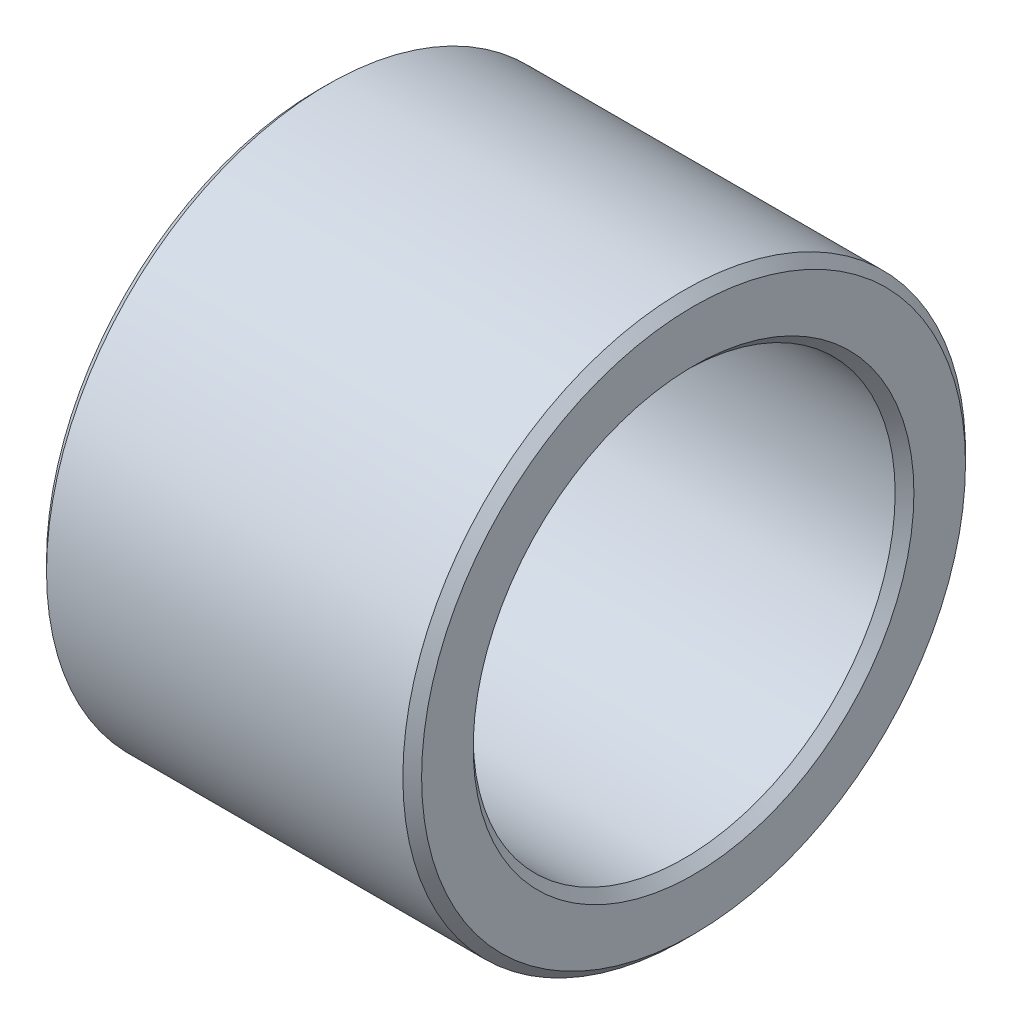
ISO-10303-21;
HEADER;
FILE_DESCRIPTION(('STEP AP214'),'2;1');
FILE_NAME('part.step','',(''),(''),'','','');
FILE_SCHEMA(('AUTOMOTIVE_DESIGN { 1 0 10303 214 1 1 1 1 }'));
ENDSEC;
DATA;
#1=APPLICATION_CONTEXT('core data for automotive mechanical design processes');
#2=APPLICATION_PROTOCOL_DEFINITION('international standard','automotive_design',2000,#1);
#3=PRODUCT_CONTEXT('',#1,'mechanical');
#4=PRODUCT('Part','Part','',(#3));
#5=PRODUCT_RELATED_PRODUCT_CATEGORY('part','',(#4));
#6=PRODUCT_DEFINITION_FORMATION('','',#4);
#7=PRODUCT_DEFINITION_CONTEXT('part definition',#1,'design');
#8=PRODUCT_DEFINITION('design','',#6,#7);
#9=PRODUCT_DEFINITION_SHAPE('','',#8);
#10=(LENGTH_UNIT() NAMED_UNIT(*) SI_UNIT(.MILLI.,.METRE.));
#11=(NAMED_UNIT(*) PLANE_ANGLE_UNIT() SI_UNIT($,.RADIAN.));
#12=(NAMED_UNIT(*) SI_UNIT($,.STERADIAN.) SOLID_ANGLE_UNIT());
#13=UNCERTAINTY_MEASURE_WITH_UNIT(LENGTH_MEASURE(1.E-05),#10,'distance_accuracy_value','');
#14=(GEOMETRIC_REPRESENTATION_CONTEXT(3) GLOBAL_UNCERTAINTY_ASSIGNED_CONTEXT((#13)) GLOBAL_UNIT_ASSIGNED_CONTEXT((#10,
#11,#12)) REPRESENTATION_CONTEXT('',''));
#15=CARTESIAN_POINT('',(0.,0.,0.));
#16=DIRECTION('',(0.,0.,1.));
#17=DIRECTION('',(1.,0.,0.));
#18=AXIS2_PLACEMENT_3D('',#15,#16,#17);
#19=CARTESIAN_POINT('',(2.22044604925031E-13,4.44089209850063E-13,0.));
#20=DIRECTION('',(-1.,0.,0.));
#21=DIRECTION('',(0.,0.,1.));
#22=AXIS2_PLACEMENT_3D('',#19,#20,#21);
#23=CONICAL_SURFACE('',#22,9.4,0.785398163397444);
#24=CARTESIAN_POINT('',(0.399999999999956,4.44089209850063E-13,-1.11022302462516E-13));
#25=DIRECTION('',(-1.,0.,0.));
#26=DIRECTION('',(0.,0.,1.));
#27=AXIS2_PLACEMENT_3D('',#24,#25,#26);
#28=CIRCLE('',#27,9.);
#29=CARTESIAN_POINT('',(0.399999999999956,4.44423664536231E-13,9.00000000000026));
#30=VERTEX_POINT('',#29);
#31=EDGE_CURVE('E58',#30,#30,#28,.T.);
#32=CARTESIAN_POINT('',(2.22044604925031E-13,4.44089209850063E-13,0.));
#33=DIRECTION('',(-1.,0.,0.));
#34=DIRECTION('',(0.,0.,1.));
#35=AXIS2_PLACEMENT_3D('',#32,#33,#34);
#36=CIRCLE('',#35,9.4);
#37=CARTESIAN_POINT('',(2.21653251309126E-13,4.44415337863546E-13,9.39999999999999));
#38=VERTEX_POINT('',#37);
#39=EDGE_CURVE('E10',#38,#38,#36,.T.);
#40=CARTESIAN_POINT('',(0.399999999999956,4.44423664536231E-13,9.00000000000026));
#41=CARTESIAN_POINT('',(0.395833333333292,4.44423577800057E-13,9.00416666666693));
#42=CARTESIAN_POINT('',(0.391666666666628,4.44423491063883E-13,9.00833333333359));
#43=CARTESIAN_POINT('',(0.3833333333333,4.44423317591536E-13,9.01666666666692));
#44=CARTESIAN_POINT('',(0.379166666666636,4.44423230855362E-13,9.02083333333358));
#45=CARTESIAN_POINT('',(0.370833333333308,4.44423057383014E-13,9.02916666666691));
#46=CARTESIAN_POINT('',(0.366666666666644,4.4442297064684E-13,9.03333333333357));
#47=CARTESIAN_POINT('',(0.358333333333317,4.44422797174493E-13,9.0416666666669));
#48=CARTESIAN_POINT('',(0.354166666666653,4.44422710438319E-13,9.04583333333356));
#49=CARTESIAN_POINT('',(0.345833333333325,4.44422536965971E-13,9.05416666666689));
#50=CARTESIAN_POINT('',(0.341666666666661,4.44422450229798E-13,9.05833333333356));
#51=CARTESIAN_POINT('',(0.333333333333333,4.4442227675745E-13,9.06666666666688));
#52=CARTESIAN_POINT('',(0.329166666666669,4.44422190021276E-13,9.07083333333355));
#53=CARTESIAN_POINT('',(0.320833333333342,4.44422016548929E-13,9.07916666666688));
#54=CARTESIAN_POINT('',(0.316666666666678,4.44421929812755E-13,9.08333333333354));
#55=CARTESIAN_POINT('',(0.30833333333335,4.44421756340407E-13,9.09166666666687));
#56=CARTESIAN_POINT('',(0.304166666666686,4.44421669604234E-13,9.09583333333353));
#57=CARTESIAN_POINT('',(0.295833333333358,4.44421496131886E-13,9.10416666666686));
#58=CARTESIAN_POINT('',(0.291666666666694,4.44421409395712E-13,9.10833333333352));
#59=CARTESIAN_POINT('',(0.283333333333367,4.44421235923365E-13,9.11666666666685));
#60=CARTESIAN_POINT('',(0.279166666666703,4.44421149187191E-13,9.12083333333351));
#61=CARTESIAN_POINT('',(0.270833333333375,4.44420975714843E-13,9.12916666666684));
#62=CARTESIAN_POINT('',(0.266666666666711,4.44420888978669E-13,9.13333333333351));
#63=CARTESIAN_POINT('',(0.258333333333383,4.44420715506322E-13,9.14166666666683));
#64=CARTESIAN_POINT('',(0.254166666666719,4.44420628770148E-13,9.1458333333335));
#65=CARTESIAN_POINT('',(0.245833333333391,4.444204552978E-13,9.15416666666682));
#66=CARTESIAN_POINT('',(0.241666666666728,4.44420368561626E-13,9.15833333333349));
#67=CARTESIAN_POINT('',(0.2333333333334,4.44420195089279E-13,9.16666666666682));
#68=CARTESIAN_POINT('',(0.229166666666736,4.44420108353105E-13,9.17083333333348));
#69=CARTESIAN_POINT('',(0.220833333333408,4.44419934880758E-13,9.17916666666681));
#70=CARTESIAN_POINT('',(0.216666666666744,4.44419848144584E-13,9.18333333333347));
#71=CARTESIAN_POINT('',(0.208333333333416,4.44419674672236E-13,9.1916666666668));
#72=CARTESIAN_POINT('',(0.204166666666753,4.44419587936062E-13,9.19583333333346));
#73=CARTESIAN_POINT('',(0.195833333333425,4.44419414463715E-13,9.20416666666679));
#74=CARTESIAN_POINT('',(0.191666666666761,4.44419327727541E-13,9.20833333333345));
#75=CARTESIAN_POINT('',(0.183333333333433,4.44419154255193E-13,9.21666666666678));
#76=CARTESIAN_POINT('',(0.179166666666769,4.4441906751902E-13,9.22083333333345));
#77=CARTESIAN_POINT('',(0.170833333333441,4.44418894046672E-13,9.22916666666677));
#78=CARTESIAN_POINT('',(0.166666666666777,4.44418807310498E-13,9.23333333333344));
#79=CARTESIAN_POINT('',(0.15833333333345,4.44418633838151E-13,9.24166666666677));
#80=CARTESIAN_POINT('',(0.154166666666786,4.44418547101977E-13,9.24583333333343));
#81=CARTESIAN_POINT('',(0.145833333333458,4.44418373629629E-13,9.25416666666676));
#82=CARTESIAN_POINT('',(0.141666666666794,4.44418286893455E-13,9.25833333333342));
#83=CARTESIAN_POINT('',(0.133333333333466,4.44418113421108E-13,9.26666666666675));
#84=CARTESIAN_POINT('',(0.129166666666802,4.44418026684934E-13,9.27083333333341));
#85=CARTESIAN_POINT('',(0.120833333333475,4.44417853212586E-13,9.27916666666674));
#86=CARTESIAN_POINT('',(0.116666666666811,4.44417766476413E-13,9.2833333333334));
#87=CARTESIAN_POINT('',(0.108333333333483,4.44417593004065E-13,9.29166666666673));
#88=CARTESIAN_POINT('',(0.104166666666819,4.44417506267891E-13,9.29583333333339));
#89=CARTESIAN_POINT('',(0.0958333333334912,4.44417332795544E-13,9.30416666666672));
#90=CARTESIAN_POINT('',(0.0916666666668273,4.4441724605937E-13,9.30833333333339));
#91=CARTESIAN_POINT('',(0.0833333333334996,4.44417072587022E-13,9.31666666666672));
#92=CARTESIAN_POINT('',(0.0791666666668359,4.44416985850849E-13,9.32083333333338));
#93=CARTESIAN_POINT('',(0.070833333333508,4.44416812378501E-13,9.32916666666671));
#94=CARTESIAN_POINT('',(0.0666666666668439,4.44416725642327E-13,9.33333333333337));
#95=CARTESIAN_POINT('',(0.058333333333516,4.4441655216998E-13,9.3416666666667));
#96=CARTESIAN_POINT('',(0.0541666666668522,4.44416465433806E-13,9.34583333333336));
#97=CARTESIAN_POINT('',(0.0458333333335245,4.44416291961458E-13,9.35416666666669));
#98=CARTESIAN_POINT('',(0.0416666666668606,4.44416205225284E-13,9.35833333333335));
#99=CARTESIAN_POINT('',(0.0333333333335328,4.44416031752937E-13,9.36666666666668));
#100=CARTESIAN_POINT('',(0.0291666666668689,4.44415945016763E-13,9.37083333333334));
#101=CARTESIAN_POINT('',(0.0208333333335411,4.44415771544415E-13,9.37916666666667));
#102=CARTESIAN_POINT('',(0.0166666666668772,4.44415684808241E-13,9.38333333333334));
#103=CARTESIAN_POINT('',(0.00833333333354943,4.44415511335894E-13,9.39166666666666));
#104=CARTESIAN_POINT('',(0.00416666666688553,4.4441542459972E-13,9.39583333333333));
#105=CARTESIAN_POINT('',(2.21643103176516E-13,4.44415337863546E-13,9.39999999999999));
#106=B_SPLINE_CURVE_WITH_KNOTS('',3,(#40,#41,#42,#43,#44,#45,#46,#47,#48,#49,#50,#51,#52,#53,
#54,#55,#56,#57,#58,#59,#60,#61,#62,#63,#64,#65,#66,#67,#68,#69,#70,#71,#72,#73,#74,#75,#76,#77,
#78,#79,#80,#81,#82,#83,#84,#85,#86,#87,#88,#89,#90,#91,#92,#93,#94,#95,#96,#97,#98,#99,#100,
#101,#102,#103,#104,#105),.UNSPECIFIED.,.F.,.F.,(4,2,2,2,2,2,2,2,2,2,2,2,2,2,2,2,2,2,2,2,2,2,2,
2,2,2,2,2,2,2,2,2,4),(0.,0.0176776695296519,0.0353553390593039,0.0530330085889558,
0.0707106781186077,0.0883883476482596,0.106066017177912,0.123743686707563,0.141421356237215,
0.159099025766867,0.176776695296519,0.194454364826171,0.212132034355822,0.229809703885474,
0.247487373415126,0.265165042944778,0.28284271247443,0.300520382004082,0.318198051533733,
0.335875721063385,0.353553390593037,0.371231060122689,0.388908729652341,0.406586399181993,
0.424264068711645,0.441941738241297,0.459619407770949,0.4772970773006,0.494974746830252,
0.512652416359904,0.530330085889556,0.548007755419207,0.565685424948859),.UNSPECIFIED.);
#107=EDGE_CURVE('BSEAM30',#30,#38,#106,.T.);
#108=ORIENTED_EDGE('',*,*,#31,.F.);
#109=ORIENTED_EDGE('',*,*,#39,.T.);
#110=ORIENTED_EDGE('',*,*,#107,.T.);
#111=ORIENTED_EDGE('',*,*,#107,.F.);
#112=EDGE_LOOP('',(#108,#110,#109,#111));
#113=FACE_BOUND('',#112,.T.);
#114=ADVANCED_FACE('F30',(#113),#23,.F.);
#115=CARTESIAN_POINT('',(0.,9.4000000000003,0.));
#116=DIRECTION('',(1.,0.,0.));
#117=DIRECTION('',(0.,0.,-1.));
#118=AXIS2_PLACEMENT_3D('',#115,#116,#117);
#119=PLANE('',#118);
#120=ORIENTED_EDGE('',*,*,#39,.F.);
#121=EDGE_LOOP('',(#120));
#122=FACE_BOUND('',#121,.T.);
#123=CARTESIAN_POINT('',(2.22044604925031E-13,4.44089209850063E-13,0.));
#124=DIRECTION('',(-1.,0.,0.));
#125=DIRECTION('',(0.,0.,1.));
#126=AXIS2_PLACEMENT_3D('',#123,#124,#125);
#127=CIRCLE('',#126,11.6);
#128=CARTESIAN_POINT('',(2.2253249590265E-13,4.43664549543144E-13,-11.6000000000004));
#129=VERTEX_POINT('',#128);
#130=EDGE_CURVE('E36',#129,#129,#127,.T.);
#131=ORIENTED_EDGE('',*,*,#130,.T.);
#132=EDGE_LOOP('',(#131));
#133=FACE_BOUND('',#132,.T.);
#134=ADVANCED_FACE('F65',(#122,#133),#119,.F.);
#135=CARTESIAN_POINT('',(0.399999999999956,4.44089209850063E-13,-1.11022302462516E-13));
#136=DIRECTION('',(1.,0.,0.));
#137=DIRECTION('',(0.,0.,-1.));
#138=AXIS2_PLACEMENT_3D('',#135,#136,#137);
#139=CONICAL_SURFACE('',#138,12.,0.785398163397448);
#140=CARTESIAN_POINT('',(0.399999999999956,4.44089209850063E-13,-1.11022302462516E-13));
#141=DIRECTION('',(-1.,0.,0.));
#142=DIRECTION('',(0.,0.,1.));
#143=AXIS2_PLACEMENT_3D('',#140,#141,#142);
#144=CIRCLE('',#143,12.);
#145=CARTESIAN_POINT('',(0.399999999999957,4.43672876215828E-13,-12.0000000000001));
#146=VERTEX_POINT('',#145);
#147=EDGE_CURVE('E40',#146,#146,#144,.T.);
#148=CARTESIAN_POINT('',(2.2253249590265E-13,4.43664549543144E-13,-11.6000000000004));
#149=CARTESIAN_POINT('',(0.00416666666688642,4.43664636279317E-13,-11.604166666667));
#150=CARTESIAN_POINT('',(0.00833333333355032,4.43664723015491E-13,-11.6083333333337));
#151=CARTESIAN_POINT('',(0.0166666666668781,4.43664896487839E-13,-11.616666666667));
#152=CARTESIAN_POINT('',(0.020833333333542,4.43664983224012E-13,-11.6208333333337));
#153=CARTESIAN_POINT('',(0.0291666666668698,4.4366515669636E-13,-11.629166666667));
#154=CARTESIAN_POINT('',(0.0333333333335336,4.43665243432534E-13,-11.6333333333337));
#155=CARTESIAN_POINT('',(0.0416666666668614,4.43665416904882E-13,-11.641666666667));
#156=CARTESIAN_POINT('',(0.0458333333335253,4.43665503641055E-13,-11.6458333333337));
#157=CARTESIAN_POINT('',(0.0541666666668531,4.43665677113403E-13,-11.654166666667));
#158=CARTESIAN_POINT('',(0.058333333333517,4.43665763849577E-13,-11.6583333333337));
#159=CARTESIAN_POINT('',(0.0666666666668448,4.43665937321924E-13,-11.666666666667));
#160=CARTESIAN_POINT('',(0.0708333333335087,4.43666024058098E-13,-11.6708333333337));
#161=CARTESIAN_POINT('',(0.0791666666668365,4.43666197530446E-13,-11.679166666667));
#162=CARTESIAN_POINT('',(0.0833333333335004,4.43666284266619E-13,-11.6833333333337));
#163=CARTESIAN_POINT('',(0.0916666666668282,4.43666457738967E-13,-11.691666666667));
#164=CARTESIAN_POINT('',(0.0958333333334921,4.43666544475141E-13,-11.6958333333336));
#165=CARTESIAN_POINT('',(0.10416666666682,4.43666717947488E-13,-11.704166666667));
#166=CARTESIAN_POINT('',(0.108333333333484,4.43666804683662E-13,-11.7083333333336));
#167=CARTESIAN_POINT('',(0.116666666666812,4.4366697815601E-13,-11.716666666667));
#168=CARTESIAN_POINT('',(0.120833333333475,4.43667064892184E-13,-11.7208333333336));
#169=CARTESIAN_POINT('',(0.129166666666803,4.43667238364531E-13,-11.729166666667));
#170=CARTESIAN_POINT('',(0.133333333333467,4.43667325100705E-13,-11.7333333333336));
#171=CARTESIAN_POINT('',(0.141666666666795,4.43667498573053E-13,-11.7416666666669));
#172=CARTESIAN_POINT('',(0.145833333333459,4.43667585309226E-13,-11.7458333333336));
#173=CARTESIAN_POINT('',(0.154166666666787,4.43667758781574E-13,-11.7541666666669));
#174=CARTESIAN_POINT('',(0.158333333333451,4.43667845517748E-13,-11.7583333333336));
#175=CARTESIAN_POINT('',(0.166666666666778,4.43668018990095E-13,-11.7666666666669));
#176=CARTESIAN_POINT('',(0.170833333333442,4.43668105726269E-13,-11.7708333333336));
#177=CARTESIAN_POINT('',(0.17916666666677,4.43668279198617E-13,-11.7791666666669));
#178=CARTESIAN_POINT('',(0.183333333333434,4.43668365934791E-13,-11.7833333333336));
#179=CARTESIAN_POINT('',(0.191666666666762,4.43668539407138E-13,-11.7916666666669));
#180=CARTESIAN_POINT('',(0.195833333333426,4.43668626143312E-13,-11.7958333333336));
#181=CARTESIAN_POINT('',(0.204166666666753,4.4366879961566E-13,-11.8041666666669));
#182=CARTESIAN_POINT('',(0.208333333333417,4.43668886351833E-13,-11.8083333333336));
#183=CARTESIAN_POINT('',(0.216666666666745,4.43669059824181E-13,-11.8166666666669));
#184=CARTESIAN_POINT('',(0.220833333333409,4.43669146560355E-13,-11.8208333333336));
#185=CARTESIAN_POINT('',(0.229166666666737,4.43669320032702E-13,-11.8291666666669));
#186=CARTESIAN_POINT('',(0.233333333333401,4.43669406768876E-13,-11.8333333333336));
#187=CARTESIAN_POINT('',(0.241666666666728,4.43669580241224E-13,-11.8416666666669));
#188=CARTESIAN_POINT('',(0.245833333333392,4.43669666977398E-13,-11.8458333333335));
#189=CARTESIAN_POINT('',(0.25416666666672,4.43669840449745E-13,-11.8541666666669));
#190=CARTESIAN_POINT('',(0.258333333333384,4.43669927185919E-13,-11.8583333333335));
#191=CARTESIAN_POINT('',(0.266666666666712,4.43670100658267E-13,-11.8666666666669));
#192=CARTESIAN_POINT('',(0.270833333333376,4.4367018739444E-13,-11.8708333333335));
#193=CARTESIAN_POINT('',(0.279166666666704,4.43670360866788E-13,-11.8791666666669));
#194=CARTESIAN_POINT('',(0.283333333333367,4.43670447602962E-13,-11.8833333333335));
#195=CARTESIAN_POINT('',(0.291666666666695,4.43670621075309E-13,-11.8916666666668));
#196=CARTESIAN_POINT('',(0.295833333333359,4.43670707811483E-13,-11.8958333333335));
#197=CARTESIAN_POINT('',(0.304166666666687,4.43670881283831E-13,-11.9041666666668));
#198=CARTESIAN_POINT('',(0.308333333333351,4.43670968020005E-13,-11.9083333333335));
#199=CARTESIAN_POINT('',(0.316666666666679,4.43671141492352E-13,-11.9166666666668));
#200=CARTESIAN_POINT('',(0.320833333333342,4.43671228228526E-13,-11.9208333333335));
#201=CARTESIAN_POINT('',(0.32916666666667,4.43671401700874E-13,-11.9291666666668));
#202=CARTESIAN_POINT('',(0.333333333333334,4.43671488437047E-13,-11.9333333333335));
#203=CARTESIAN_POINT('',(0.341666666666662,4.43671661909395E-13,-11.9416666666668));
#204=CARTESIAN_POINT('',(0.345833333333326,4.43671748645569E-13,-11.9458333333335));
#205=CARTESIAN_POINT('',(0.354166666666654,4.43671922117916E-13,-11.9541666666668));
#206=CARTESIAN_POINT('',(0.358333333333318,4.4367200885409E-13,-11.9583333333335));
#207=CARTESIAN_POINT('',(0.366666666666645,4.43672182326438E-13,-11.9666666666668));
#208=CARTESIAN_POINT('',(0.370833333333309,4.43672269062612E-13,-11.9708333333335));
#209=CARTESIAN_POINT('',(0.379166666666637,4.43672442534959E-13,-11.9791666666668));
#210=CARTESIAN_POINT('',(0.383333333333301,4.43672529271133E-13,-11.9833333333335));
#211=CARTESIAN_POINT('',(0.391666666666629,4.43672702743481E-13,-11.9916666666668));
#212=CARTESIAN_POINT('',(0.395833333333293,4.43672789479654E-13,-11.9958333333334));
#213=CARTESIAN_POINT('',(0.399999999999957,4.43672876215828E-13,-12.0000000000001));
#214=B_SPLINE_CURVE_WITH_KNOTS('',3,(#148,#149,#150,#151,#152,#153,#154,#155,#156,#157,#158,
#159,#160,#161,#162,#163,#164,#165,#166,#167,#168,#169,#170,#171,#172,#173,#174,#175,#176,#177,
#178,#179,#180,#181,#182,#183,#184,#185,#186,#187,#188,#189,#190,#191,#192,#193,#194,#195,#196,
#197,#198,#199,#200,#201,#202,#203,#204,#205,#206,#207,#208,#209,#210,#211,#212,#213),
.UNSPECIFIED.,.F.,.F.,(4,2,2,2,2,2,2,2,2,2,2,2,2,2,2,2,2,2,2,2,2,2,2,2,2,2,2,2,2,2,2,2,4),(0.,
0.0176776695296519,0.0353553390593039,0.0530330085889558,0.0707106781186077,0.0883883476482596,
0.106066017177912,0.123743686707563,0.141421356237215,0.159099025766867,0.176776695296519,
0.194454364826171,0.212132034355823,0.229809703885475,0.247487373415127,0.265165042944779,
0.282842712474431,0.300520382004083,0.318198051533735,0.335875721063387,0.353553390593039,
0.371231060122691,0.388908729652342,0.406586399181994,0.424264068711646,0.441941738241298,
0.45961940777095,0.477297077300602,0.494974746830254,0.512652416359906,0.530330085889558,
0.54800775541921,0.565685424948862),.UNSPECIFIED.);
#215=EDGE_CURVE('BSEAM69',#129,#146,#214,.T.);
#216=ORIENTED_EDGE('',*,*,#130,.F.);
#217=ORIENTED_EDGE('',*,*,#147,.T.);
#218=ORIENTED_EDGE('',*,*,#215,.T.);
#219=ORIENTED_EDGE('',*,*,#215,.F.);
#220=EDGE_LOOP('',(#216,#218,#217,#219));
#221=FACE_BOUND('',#220,.T.);
#222=ADVANCED_FACE('F69',(#221),#139,.T.);
#223=CARTESIAN_POINT('',(2.22044604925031E-13,4.44089209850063E-13,0.));
#224=DIRECTION('',(-1.,0.,0.));
#225=DIRECTION('',(0.,0.,1.));
#226=AXIS2_PLACEMENT_3D('',#223,#224,#225);
#227=CYLINDRICAL_SURFACE('',#226,12.);
#228=ORIENTED_EDGE('',*,*,#147,.F.);
#229=EDGE_LOOP('',(#228));
#230=FACE_BOUND('',#229,.T.);
#231=CARTESIAN_POINT('',(15.6000000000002,-2.22044604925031E-13,0.));
#232=DIRECTION('',(-1.,0.,0.));
#233=DIRECTION('',(0.,0.,1.));
#234=AXIS2_PLACEMENT_3D('',#231,#232,#233);
#235=CIRCLE('',#234,12.);
#236=CARTESIAN_POINT('',(15.6000000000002,0.,11.9999999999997));
#237=VERTEX_POINT('',#236);
#238=EDGE_CURVE('E44',#237,#237,#235,.T.);
#239=ORIENTED_EDGE('',*,*,#238,.T.);
#240=EDGE_LOOP('',(#239));
#241=FACE_BOUND('',#240,.T.);
#242=ADVANCED_FACE('F74',(#230,#241),#227,.T.);
#243=CARTESIAN_POINT('',(15.9999999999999,0.,0.));
#244=DIRECTION('',(-1.,0.,0.));
#245=DIRECTION('',(0.,0.,1.));
#246=AXIS2_PLACEMENT_3D('',#243,#244,#245);
#247=CONICAL_SURFACE('',#246,11.6,0.785398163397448);
#248=CARTESIAN_POINT('',(15.9999999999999,0.,0.));
#249=DIRECTION('',(-1.,0.,0.));
#250=DIRECTION('',(0.,0.,1.));
#251=AXIS2_PLACEMENT_3D('',#248,#249,#250);
#252=CIRCLE('',#251,11.6);
#253=CARTESIAN_POINT('',(15.9999999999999,0.,11.6));
#254=VERTEX_POINT('',#253);
#255=EDGE_CURVE('E49',#254,#254,#252,.T.);
#256=CARTESIAN_POINT('',(15.6000000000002,0.,11.9999999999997));
#257=CARTESIAN_POINT('',(15.6041666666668,0.,11.9958333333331));
#258=CARTESIAN_POINT('',(15.6083333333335,0.,11.9916666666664));
#259=CARTESIAN_POINT('',(15.6166666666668,0.,11.9833333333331));
#260=CARTESIAN_POINT('',(15.6208333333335,0.,11.9791666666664));
#261=CARTESIAN_POINT('',(15.6291666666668,0.,11.9708333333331));
#262=CARTESIAN_POINT('',(15.6333333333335,0.,11.9666666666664));
#263=CARTESIAN_POINT('',(15.6416666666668,0.,11.9583333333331));
#264=CARTESIAN_POINT('',(15.6458333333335,0.,11.9541666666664));
#265=CARTESIAN_POINT('',(15.6541666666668,0.,11.9458333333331));
#266=CARTESIAN_POINT('',(15.6583333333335,0.,11.9416666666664));
#267=CARTESIAN_POINT('',(15.6666666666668,0.,11.9333333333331));
#268=CARTESIAN_POINT('',(15.6708333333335,0.,11.9291666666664));
#269=CARTESIAN_POINT('',(15.6791666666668,0.,11.9208333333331));
#270=CARTESIAN_POINT('',(15.6833333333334,0.,11.9166666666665));
#271=CARTESIAN_POINT('',(15.6916666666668,0.,11.9083333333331));
#272=CARTESIAN_POINT('',(15.6958333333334,0.,11.9041666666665));
#273=CARTESIAN_POINT('',(15.7041666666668,0.,11.8958333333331));
#274=CARTESIAN_POINT('',(15.7083333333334,0.,11.8916666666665));
#275=CARTESIAN_POINT('',(15.7166666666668,0.,11.8833333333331));
#276=CARTESIAN_POINT('',(15.7208333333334,0.,11.8791666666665));
#277=CARTESIAN_POINT('',(15.7291666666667,0.,11.8708333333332));
#278=CARTESIAN_POINT('',(15.7333333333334,0.,11.8666666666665));
#279=CARTESIAN_POINT('',(15.7416666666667,0.,11.8583333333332));
#280=CARTESIAN_POINT('',(15.7458333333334,0.,11.8541666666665));
#281=CARTESIAN_POINT('',(15.7541666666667,0.,11.8458333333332));
#282=CARTESIAN_POINT('',(15.7583333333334,0.,11.8416666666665));
#283=CARTESIAN_POINT('',(15.7666666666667,0.,11.8333333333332));
#284=CARTESIAN_POINT('',(15.7708333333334,0.,11.8291666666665));
#285=CARTESIAN_POINT('',(15.7791666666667,0.,11.8208333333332));
#286=CARTESIAN_POINT('',(15.7833333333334,0.,11.8166666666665));
#287=CARTESIAN_POINT('',(15.7916666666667,0.,11.8083333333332));
#288=CARTESIAN_POINT('',(15.7958333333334,0.,11.8041666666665));
#289=CARTESIAN_POINT('',(15.8041666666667,0.,11.7958333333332));
#290=CARTESIAN_POINT('',(15.8083333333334,0.,11.7916666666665));
#291=CARTESIAN_POINT('',(15.8166666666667,0.,11.7833333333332));
#292=CARTESIAN_POINT('',(15.8208333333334,0.,11.7791666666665));
#293=CARTESIAN_POINT('',(15.8291666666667,0.,11.7708333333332));
#294=CARTESIAN_POINT('',(15.8333333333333,0.,11.7666666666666));
#295=CARTESIAN_POINT('',(15.8416666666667,0.,11.7583333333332));
#296=CARTESIAN_POINT('',(15.8458333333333,0.,11.7541666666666));
#297=CARTESIAN_POINT('',(15.8541666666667,0.,11.7458333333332));
#298=CARTESIAN_POINT('',(15.8583333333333,0.,11.7416666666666));
#299=CARTESIAN_POINT('',(15.8666666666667,0.,11.7333333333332));
#300=CARTESIAN_POINT('',(15.8708333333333,0.,11.7291666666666));
#301=CARTESIAN_POINT('',(15.8791666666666,0.,11.7208333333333));
#302=CARTESIAN_POINT('',(15.8833333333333,0.,11.7166666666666));
#303=CARTESIAN_POINT('',(15.8916666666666,0.,11.7083333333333));
#304=CARTESIAN_POINT('',(15.8958333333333,0.,11.7041666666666));
#305=CARTESIAN_POINT('',(15.9041666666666,0.,11.6958333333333));
#306=CARTESIAN_POINT('',(15.9083333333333,0.,11.6916666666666));
#307=CARTESIAN_POINT('',(15.9166666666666,0.,11.6833333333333));
#308=CARTESIAN_POINT('',(15.9208333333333,0.,11.6791666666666));
#309=CARTESIAN_POINT('',(15.9291666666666,0.,11.6708333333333));
#310=CARTESIAN_POINT('',(15.9333333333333,0.,11.6666666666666));
#311=CARTESIAN_POINT('',(15.9416666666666,0.,11.6583333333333));
#312=CARTESIAN_POINT('',(15.9458333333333,0.,11.6541666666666));
#313=CARTESIAN_POINT('',(15.9541666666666,0.,11.6458333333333));
#314=CARTESIAN_POINT('',(15.9583333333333,0.,11.6416666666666));
#315=CARTESIAN_POINT('',(15.9666666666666,0.,11.6333333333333));
#316=CARTESIAN_POINT('',(15.9708333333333,0.,11.6291666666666));
#317=CARTESIAN_POINT('',(15.9791666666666,0.,11.6208333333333));
#318=CARTESIAN_POINT('',(15.9833333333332,0.,11.6166666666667));
#319=CARTESIAN_POINT('',(15.9916666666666,0.,11.6083333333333));
#320=CARTESIAN_POINT('',(15.9958333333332,0.,11.6041666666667));
#321=CARTESIAN_POINT('',(15.9999999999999,0.,11.6));
#322=B_SPLINE_CURVE_WITH_KNOTS('',3,(#256,#257,#258,#259,#260,#261,#262,#263,#264,#265,#266,
#267,#268,#269,#270,#271,#272,#273,#274,#275,#276,#277,#278,#279,#280,#281,#282,#283,#284,#285,
#286,#287,#288,#289,#290,#291,#292,#293,#294,#295,#296,#297,#298,#299,#300,#301,#302,#303,#304,
#305,#306,#307,#308,#309,#310,#311,#312,#313,#314,#315,#316,#317,#318,#319,#320,#321),
.UNSPECIFIED.,.F.,.F.,(4,2,2,2,2,2,2,2,2,2,2,2,2,2,2,2,2,2,2,2,2,2,2,2,2,2,2,2,2,2,2,2,4),(0.,
0.0176776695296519,0.0353553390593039,0.0530330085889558,0.0707106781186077,0.0883883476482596,
0.106066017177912,0.123743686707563,0.141421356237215,0.159099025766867,0.176776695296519,
0.194454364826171,0.212132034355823,0.229809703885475,0.247487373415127,0.265165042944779,
0.282842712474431,0.300520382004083,0.318198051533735,0.335875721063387,0.353553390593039,
0.371231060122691,0.388908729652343,0.406586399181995,0.424264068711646,0.441941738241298,
0.45961940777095,0.477297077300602,0.494974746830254,0.512652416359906,0.530330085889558,
0.54800775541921,0.565685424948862),.UNSPECIFIED.);
#323=EDGE_CURVE('BSEAM80',#237,#254,#322,.T.);
#324=ORIENTED_EDGE('',*,*,#238,.F.);
#325=ORIENTED_EDGE('',*,*,#255,.T.);
#326=ORIENTED_EDGE('',*,*,#323,.T.);
#327=ORIENTED_EDGE('',*,*,#323,.F.);
#328=EDGE_LOOP('',(#324,#326,#325,#327));
#329=FACE_BOUND('',#328,.T.);
#330=ADVANCED_FACE('F80',(#329),#247,.T.);
#331=CARTESIAN_POINT('',(16.0000000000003,11.5999999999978,-1.66533453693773E-13));
#332=DIRECTION('',(-1.,0.,0.));
#333=DIRECTION('',(0.,0.,1.));
#334=AXIS2_PLACEMENT_3D('',#331,#332,#333);
#335=PLANE('',#334);
#336=ORIENTED_EDGE('',*,*,#255,.F.);
#337=EDGE_LOOP('',(#336));
#338=FACE_BOUND('',#337,.T.);
#339=CARTESIAN_POINT('',(15.9999999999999,0.,0.));
#340=DIRECTION('',(-1.,0.,0.));
#341=DIRECTION('',(0.,0.,1.));
#342=AXIS2_PLACEMENT_3D('',#339,#340,#341);
#343=CIRCLE('',#342,9.4);
#344=CARTESIAN_POINT('',(15.9999999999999,-2.22348528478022E-13,-9.39999999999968));
#345=VERTEX_POINT('',#344);
#346=EDGE_CURVE('E52',#345,#345,#343,.T.);
#347=ORIENTED_EDGE('',*,*,#346,.T.);
#348=EDGE_LOOP('',(#347));
#349=FACE_BOUND('',#348,.T.);
#350=ADVANCED_FACE('F84',(#338,#349),#335,.F.);
#351=CARTESIAN_POINT('',(15.6000000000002,-2.22044604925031E-13,0.));
#352=DIRECTION('',(1.,0.,0.));
#353=DIRECTION('',(0.,0.,-1.));
#354=AXIS2_PLACEMENT_3D('',#351,#352,#353);
#355=CONICAL_SURFACE('',#354,9.,0.785398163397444);
#356=CARTESIAN_POINT('',(15.6000000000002,-2.22044604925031E-13,0.));
#357=DIRECTION('',(-1.,0.,0.));
#358=DIRECTION('',(0.,0.,1.));
#359=AXIS2_PLACEMENT_3D('',#356,#357,#358);
#360=CIRCLE('',#359,9.);
#361=CARTESIAN_POINT('',(15.6000000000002,-2.22356855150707E-13,-8.99999999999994));
#362=VERTEX_POINT('',#361);
#363=EDGE_CURVE('E55',#362,#362,#360,.T.);
#364=CARTESIAN_POINT('',(15.9999999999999,-2.22348528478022E-13,-9.39999999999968));
#365=CARTESIAN_POINT('',(15.9958333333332,-2.22348615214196E-13,-9.39583333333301));
#366=CARTESIAN_POINT('',(15.9916666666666,-2.2234870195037E-13,-9.39166666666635));
#367=CARTESIAN_POINT('',(15.9833333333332,-2.22348875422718E-13,-9.38333333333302));
#368=CARTESIAN_POINT('',(15.9791666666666,-2.22348962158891E-13,-9.37916666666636));
#369=CARTESIAN_POINT('',(15.9708333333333,-2.22349135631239E-13,-9.37083333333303));
#370=CARTESIAN_POINT('',(15.9666666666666,-2.22349222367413E-13,-9.36666666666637));
#371=CARTESIAN_POINT('',(15.9583333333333,-2.2234939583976E-13,-9.35833333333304));
#372=CARTESIAN_POINT('',(15.9541666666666,-2.22349482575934E-13,-9.35416666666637));
#373=CARTESIAN_POINT('',(15.9458333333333,-2.22349656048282E-13,-9.34583333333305));
#374=CARTESIAN_POINT('',(15.9416666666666,-2.22349742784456E-13,-9.34166666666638));
#375=CARTESIAN_POINT('',(15.9333333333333,-2.22349916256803E-13,-9.33333333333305));
#376=CARTESIAN_POINT('',(15.9291666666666,-2.22350002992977E-13,-9.32916666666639));
#377=CARTESIAN_POINT('',(15.9208333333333,-2.22350176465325E-13,-9.32083333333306));
#378=CARTESIAN_POINT('',(15.9166666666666,-2.22350263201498E-13,-9.3166666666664));
#379=CARTESIAN_POINT('',(15.9083333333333,-2.22350436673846E-13,-9.30833333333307));
#380=CARTESIAN_POINT('',(15.9041666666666,-2.2235052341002E-13,-9.30416666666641));
#381=CARTESIAN_POINT('',(15.8958333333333,-2.22350696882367E-13,-9.29583333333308));
#382=CARTESIAN_POINT('',(15.8916666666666,-2.22350783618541E-13,-9.29166666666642));
#383=CARTESIAN_POINT('',(15.8833333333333,-2.22350957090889E-13,-9.28333333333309));
#384=CARTESIAN_POINT('',(15.8791666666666,-2.22351043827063E-13,-9.27916666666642));
#385=CARTESIAN_POINT('',(15.8708333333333,-2.2235121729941E-13,-9.2708333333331));
#386=CARTESIAN_POINT('',(15.8666666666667,-2.22351304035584E-13,-9.26666666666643));
#387=CARTESIAN_POINT('',(15.8583333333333,-2.22351477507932E-13,-9.25833333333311));
#388=CARTESIAN_POINT('',(15.8541666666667,-2.22351564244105E-13,-9.25416666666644));
#389=CARTESIAN_POINT('',(15.8458333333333,-2.22351737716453E-13,-9.24583333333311));
#390=CARTESIAN_POINT('',(15.8416666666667,-2.22351824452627E-13,-9.24166666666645));
#391=CARTESIAN_POINT('',(15.8333333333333,-2.22351997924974E-13,-9.23333333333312));
#392=CARTESIAN_POINT('',(15.8291666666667,-2.22352084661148E-13,-9.22916666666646));
#393=CARTESIAN_POINT('',(15.8208333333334,-2.22352258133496E-13,-9.22083333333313));
#394=CARTESIAN_POINT('',(15.8166666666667,-2.2235234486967E-13,-9.21666666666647));
#395=CARTESIAN_POINT('',(15.8083333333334,-2.22352518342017E-13,-9.20833333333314));
#396=CARTESIAN_POINT('',(15.8041666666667,-2.22352605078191E-13,-9.20416666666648));
#397=CARTESIAN_POINT('',(15.7958333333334,-2.22352778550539E-13,-9.19583333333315));
#398=CARTESIAN_POINT('',(15.7916666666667,-2.22352865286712E-13,-9.19166666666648));
#399=CARTESIAN_POINT('',(15.7833333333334,-2.2235303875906E-13,-9.18333333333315));
#400=CARTESIAN_POINT('',(15.7791666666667,-2.22353125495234E-13,-9.17916666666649));
#401=CARTESIAN_POINT('',(15.7708333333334,-2.22353298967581E-13,-9.17083333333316));
#402=CARTESIAN_POINT('',(15.7666666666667,-2.22353385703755E-13,-9.1666666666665));
#403=CARTESIAN_POINT('',(15.7583333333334,-2.22353559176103E-13,-9.15833333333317));
#404=CARTESIAN_POINT('',(15.7541666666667,-2.22353645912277E-13,-9.15416666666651));
#405=CARTESIAN_POINT('',(15.7458333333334,-2.22353819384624E-13,-9.14583333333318));
#406=CARTESIAN_POINT('',(15.7416666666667,-2.22353906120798E-13,-9.14166666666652));
#407=CARTESIAN_POINT('',(15.7333333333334,-2.22354079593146E-13,-9.13333333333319));
#408=CARTESIAN_POINT('',(15.7291666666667,-2.22354166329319E-13,-9.12916666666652));
#409=CARTESIAN_POINT('',(15.7208333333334,-2.22354339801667E-13,-9.1208333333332));
#410=CARTESIAN_POINT('',(15.7166666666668,-2.22354426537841E-13,-9.11666666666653));
#411=CARTESIAN_POINT('',(15.7083333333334,-2.22354600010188E-13,-9.1083333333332));
#412=CARTESIAN_POINT('',(15.7041666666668,-2.22354686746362E-13,-9.10416666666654));
#413=CARTESIAN_POINT('',(15.6958333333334,-2.2235486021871E-13,-9.09583333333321));
#414=CARTESIAN_POINT('',(15.6916666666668,-2.22354946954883E-13,-9.09166666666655));
#415=CARTESIAN_POINT('',(15.6833333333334,-2.22355120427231E-13,-9.08333333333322));
#416=CARTESIAN_POINT('',(15.6791666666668,-2.22355207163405E-13,-9.07916666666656));
#417=CARTESIAN_POINT('',(15.6708333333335,-2.22355380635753E-13,-9.07083333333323));
#418=CARTESIAN_POINT('',(15.6666666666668,-2.22355467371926E-13,-9.06666666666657));
#419=CARTESIAN_POINT('',(15.6583333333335,-2.22355640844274E-13,-9.05833333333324));
#420=CARTESIAN_POINT('',(15.6541666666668,-2.22355727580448E-13,-9.05416666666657));
#421=CARTESIAN_POINT('',(15.6458333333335,-2.22355901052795E-13,-9.04583333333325));
#422=CARTESIAN_POINT('',(15.6416666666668,-2.22355987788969E-13,-9.04166666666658));
#423=CARTESIAN_POINT('',(15.6333333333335,-2.22356161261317E-13,-9.03333333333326));
#424=CARTESIAN_POINT('',(15.6291666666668,-2.22356247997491E-13,-9.02916666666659));
#425=CARTESIAN_POINT('',(15.6208333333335,-2.22356421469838E-13,-9.02083333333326));
#426=CARTESIAN_POINT('',(15.6166666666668,-2.22356508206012E-13,-9.0166666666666));
#427=CARTESIAN_POINT('',(15.6083333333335,-2.2235668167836E-13,-9.00833333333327));
#428=CARTESIAN_POINT('',(15.6041666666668,-2.22356768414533E-13,-9.00416666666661));
#429=CARTESIAN_POINT('',(15.6000000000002,-2.22356855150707E-13,-8.99999999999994));
#430=B_SPLINE_CURVE_WITH_KNOTS('',3,(#364,#365,#366,#367,#368,#369,#370,#371,#372,#373,#374,
#375,#376,#377,#378,#379,#380,#381,#382,#383,#384,#385,#386,#387,#388,#389,#390,#391,#392,#393,
#394,#395,#396,#397,#398,#399,#400,#401,#402,#403,#404,#405,#406,#407,#408,#409,#410,#411,#412,
#413,#414,#415,#416,#417,#418,#419,#420,#421,#422,#423,#424,#425,#426,#427,#428,#429),
.UNSPECIFIED.,.F.,.F.,(4,2,2,2,2,2,2,2,2,2,2,2,2,2,2,2,2,2,2,2,2,2,2,2,2,2,2,2,2,2,2,2,4),(0.,
0.0176776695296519,0.0353553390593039,0.0530330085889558,0.0707106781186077,0.0883883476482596,
0.106066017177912,0.123743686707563,0.141421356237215,0.159099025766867,0.176776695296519,
0.19445436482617,0.212132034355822,0.229809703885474,0.247487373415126,0.265165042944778,
0.28284271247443,0.300520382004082,0.318198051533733,0.335875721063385,0.353553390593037,
0.371231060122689,0.388908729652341,0.406586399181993,0.424264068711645,0.441941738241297,
0.459619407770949,0.477297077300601,0.494974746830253,0.512652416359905,0.530330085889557,
0.548007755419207,0.565685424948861),.UNSPECIFIED.);
#431=EDGE_CURVE('BSEAM88',#345,#362,#430,.T.);
#432=ORIENTED_EDGE('',*,*,#346,.F.);
#433=ORIENTED_EDGE('',*,*,#363,.T.);
#434=ORIENTED_EDGE('',*,*,#431,.T.);
#435=ORIENTED_EDGE('',*,*,#431,.F.);
#436=EDGE_LOOP('',(#432,#434,#433,#435));
#437=FACE_BOUND('',#436,.T.);
#438=ADVANCED_FACE('F88',(#437),#355,.F.);
#439=CARTESIAN_POINT('',(2.22044604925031E-13,4.44089209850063E-13,0.));
#440=DIRECTION('',(-1.,0.,0.));
#441=DIRECTION('',(0.,0.,1.));
#442=AXIS2_PLACEMENT_3D('',#439,#440,#441);
#443=CYLINDRICAL_SURFACE('',#442,9.);
#444=ORIENTED_EDGE('',*,*,#363,.F.);
#445=EDGE_LOOP('',(#444));
#446=FACE_BOUND('',#445,.T.);
#447=ORIENTED_EDGE('',*,*,#31,.T.);
#448=EDGE_LOOP('',(#447));
#449=FACE_BOUND('',#448,.T.);
#450=ADVANCED_FACE('F62',(#446,#449),#443,.F.);
#451=CLOSED_SHELL('',(#114,#134,#222,#242,#330,#350,#438,#450));
#452=MANIFOLD_SOLID_BREP('B2',#451);
#453=ADVANCED_BREP_SHAPE_REPRESENTATION('',(#18,#452),#14);
#454=SHAPE_DEFINITION_REPRESENTATION(#9,#453);
ENDSEC;
END-ISO-10303-21;
